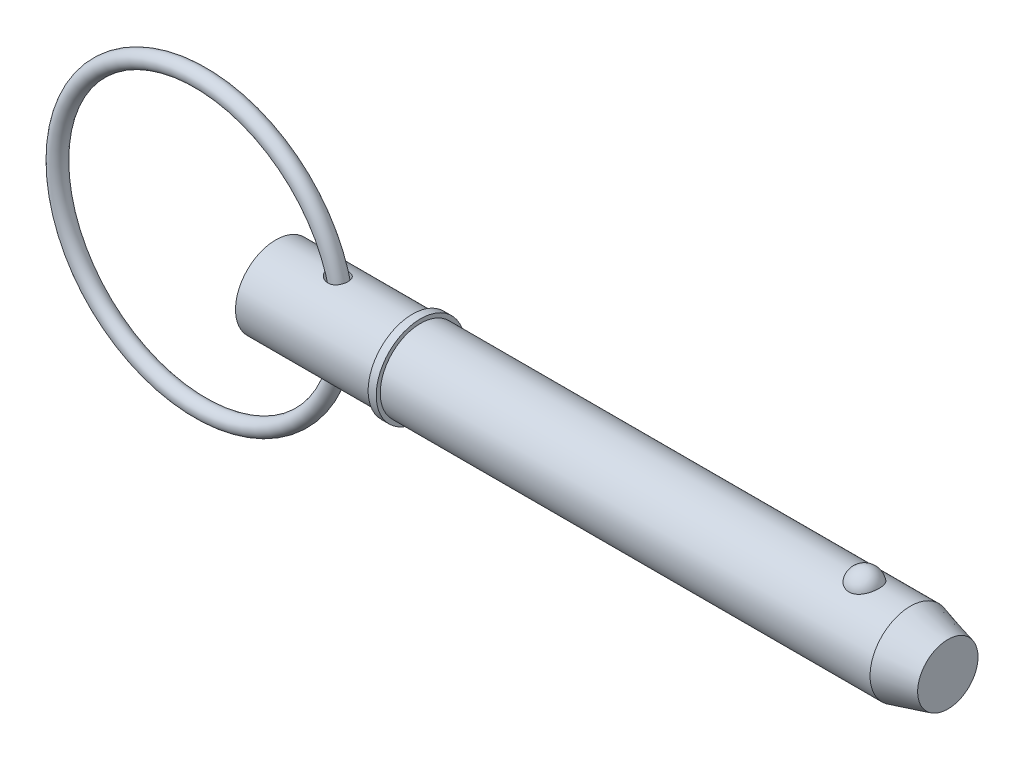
ISO-10303-21;
HEADER;
FILE_DESCRIPTION(('STEP AP214'),'2;1');
FILE_NAME('part.step','',(''),(''),'','','');
FILE_SCHEMA(('AUTOMOTIVE_DESIGN { 1 0 10303 214 1 1 1 1 }'));
ENDSEC;
DATA;
#1=APPLICATION_CONTEXT('core data for automotive mechanical design processes');
#2=APPLICATION_PROTOCOL_DEFINITION('international standard','automotive_design',2000,#1);
#3=PRODUCT_CONTEXT('',#1,'mechanical');
#4=PRODUCT('Part','Part','',(#3));
#5=PRODUCT_RELATED_PRODUCT_CATEGORY('part','',(#4));
#6=PRODUCT_DEFINITION_FORMATION('','',#4);
#7=PRODUCT_DEFINITION_CONTEXT('part definition',#1,'design');
#8=PRODUCT_DEFINITION('design','',#6,#7);
#9=PRODUCT_DEFINITION_SHAPE('','',#8);
#10=(LENGTH_UNIT() NAMED_UNIT(*) SI_UNIT(.MILLI.,.METRE.));
#11=(NAMED_UNIT(*) PLANE_ANGLE_UNIT() SI_UNIT($,.RADIAN.));
#12=(NAMED_UNIT(*) SI_UNIT($,.STERADIAN.) SOLID_ANGLE_UNIT());
#13=UNCERTAINTY_MEASURE_WITH_UNIT(LENGTH_MEASURE(1.E-05),#10,'distance_accuracy_value','');
#14=(GEOMETRIC_REPRESENTATION_CONTEXT(3) GLOBAL_UNCERTAINTY_ASSIGNED_CONTEXT((#13)) GLOBAL_UNIT_ASSIGNED_CONTEXT((#10,
#11,#12)) REPRESENTATION_CONTEXT('',''));
#15=CARTESIAN_POINT('',(0.,0.,0.));
#16=DIRECTION('',(0.,0.,1.));
#17=DIRECTION('',(1.,0.,0.));
#18=AXIS2_PLACEMENT_3D('',#15,#16,#17);
#19=CARTESIAN_POINT('',(-13.3805387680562,0.,0.));
#20=DIRECTION('',(0.,0.,1.));
#21=DIRECTION('',(1.,0.,0.));
#22=AXIS2_PLACEMENT_3D('',#19,#20,#21);
#23=TOROIDAL_SURFACE('',#22,25.4,1.429);
#24=CARTESIAN_POINT('',(13.4484612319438,0.,0.));
#25=VERTEX_POINT('',#24);
#26=VERTEX_LOOP('',#25);
#27=FACE_BOUND('',#26,.T.);
#28=ADVANCED_FACE('P0_F12',(#27),#23,.T.);
#29=CLOSED_SHELL('',(#28));
#30=MANIFOLD_SOLID_BREP('P0_B1',#29);
#31=CARTESIAN_POINT('',(0.,0.,0.));
#32=DIRECTION('',(1.,0.,0.));
#33=DIRECTION('',(0.,0.,-1.));
#34=AXIS2_PLACEMENT_3D('',#31,#32,#33);
#35=CYLINDRICAL_SURFACE('',#34,7.145);
#36=CARTESIAN_POINT('',(9.43029029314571,7.0820748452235,-0.946171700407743));
#37=CARTESIAN_POINT('',(9.49289741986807,7.07004660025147,-1.03619677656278));
#38=CARTESIAN_POINT('',(9.56370593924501,7.05703049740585,-1.12049617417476));
#39=CARTESIAN_POINT('',(9.71869321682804,7.03060933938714,-1.27585605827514));
#40=CARTESIAN_POINT('',(9.80290151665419,7.01720347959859,-1.34688652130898));
#41=CARTESIAN_POINT('',(9.98160385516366,6.99158714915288,-1.47408585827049));
#42=CARTESIAN_POINT('',(10.0760626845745,6.97937284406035,-1.53030346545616));
#43=CARTESIAN_POINT('',(10.2729508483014,6.95747410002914,-1.62697341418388));
#44=CARTESIAN_POINT('',(10.3753769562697,6.9477886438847,-1.66743209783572));
#45=CARTESIAN_POINT('',(10.5898946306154,6.93181594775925,-1.73266776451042));
#46=CARTESIAN_POINT('',(10.7022085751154,6.92567913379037,-1.75675727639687));
#47=CARTESIAN_POINT('',(10.9294935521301,6.91839634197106,-1.78523005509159));
#48=CARTESIAN_POINT('',(11.0444638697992,6.91724903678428,-1.78961856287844));
#49=CARTESIAN_POINT('',(11.2673249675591,6.92023954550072,-1.77801517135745));
#50=CARTESIAN_POINT('',(11.3752729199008,6.9241055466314,-1.7630715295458));
#51=CARTESIAN_POINT('',(11.5865707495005,6.93632220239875,-1.71437618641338));
#52=CARTESIAN_POINT('',(11.6899227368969,6.94467077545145,-1.68063321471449));
#53=CARTESIAN_POINT('',(11.8814537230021,6.96412118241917,-1.59802791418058));
#54=CARTESIAN_POINT('',(11.9701885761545,6.97498839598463,-1.55039425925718));
#55=CARTESIAN_POINT('',(12.1379548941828,6.99847346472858,-1.44066970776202));
#56=CARTESIAN_POINT('',(12.216987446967,7.01109112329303,-1.37858043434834));
#57=CARTESIAN_POINT('',(12.3614636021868,7.03632910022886,-1.24326778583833));
#58=CARTESIAN_POINT('',(12.4271729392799,7.04894297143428,-1.17032635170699));
#59=CARTESIAN_POINT('',(12.5455377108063,7.07306867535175,-1.01436746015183));
#60=CARTESIAN_POINT('',(12.5981928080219,7.08458047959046,-0.931349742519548));
#61=CARTESIAN_POINT('',(12.6896059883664,7.10535787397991,-0.75677050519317));
#62=CARTESIAN_POINT('',(12.7282356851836,7.11460247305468,-0.665139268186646));
#63=CARTESIAN_POINT('',(12.7900431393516,7.12971795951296,-0.476541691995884));
#64=CARTESIAN_POINT('',(12.8132203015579,7.13558871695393,-0.379575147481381));
#65=CARTESIAN_POINT('',(12.843715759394,7.14336270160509,-0.182249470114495));
#66=CARTESIAN_POINT('',(12.8509095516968,7.14523477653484,-0.0818698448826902));
#67=CARTESIAN_POINT('',(12.8489064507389,7.14471772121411,0.11871563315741));
#68=CARTESIAN_POINT('',(12.8397092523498,7.14232851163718,0.218921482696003));
#69=CARTESIAN_POINT('',(12.8051110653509,7.13353949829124,0.416446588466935));
#70=CARTESIAN_POINT('',(12.7796895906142,7.12713462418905,0.51376203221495));
#71=CARTESIAN_POINT('',(12.7132079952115,7.1110024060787,0.702607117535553));
#72=CARTESIAN_POINT('',(12.6721476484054,7.10127501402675,0.794136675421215));
#73=CARTESIAN_POINT('',(12.5754142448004,7.07957648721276,0.9686879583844));
#74=CARTESIAN_POINT('',(12.5197583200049,7.06760798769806,1.05171950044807));
#75=CARTESIAN_POINT('',(12.3951873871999,7.04275315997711,1.20699878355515));
#76=CARTESIAN_POINT('',(12.3262733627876,7.02986689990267,1.27924732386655));
#77=CARTESIAN_POINT('',(12.1775943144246,7.00473797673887,1.41035599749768));
#78=CARTESIAN_POINT('',(12.0979195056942,6.99249102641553,1.46931758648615));
#79=CARTESIAN_POINT('',(11.9295314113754,6.96991222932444,1.57295053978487));
#80=CARTESIAN_POINT('',(11.840819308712,6.9595801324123,1.61762377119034));
#81=CARTESIAN_POINT('',(11.6577653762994,6.94204625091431,1.69128599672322));
#82=CARTESIAN_POINT('',(11.5634812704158,6.93481718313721,1.72041226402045));
#83=CARTESIAN_POINT('',(11.3712731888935,6.92407027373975,1.76316901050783));
#84=CARTESIAN_POINT('',(11.2733489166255,6.92055273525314,1.7767982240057));
#85=CARTESIAN_POINT('',(11.0745092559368,6.91745053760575,1.78883853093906));
#86=CARTESIAN_POINT('',(10.9735737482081,6.91794816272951,1.7869312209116));
#87=CARTESIAN_POINT('',(10.7732766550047,6.92286647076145,1.76777696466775));
#88=CARTESIAN_POINT('',(10.6739155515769,6.92728833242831,1.75052540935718));
#89=CARTESIAN_POINT('',(10.4726907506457,6.93987626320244,1.69995986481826));
#90=CARTESIAN_POINT('',(10.3710860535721,6.94826759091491,1.66567223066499));
#91=CARTESIAN_POINT('',(10.1746512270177,6.96783543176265,1.5818155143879));
#92=CARTESIAN_POINT('',(10.0798244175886,6.97901329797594,1.53223900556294));
#93=CARTESIAN_POINT('',(9.89353725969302,7.00369413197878,1.41530336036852));
#94=CARTESIAN_POINT('',(9.80266896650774,7.01729943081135,1.34701798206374));
#95=CARTESIAN_POINT('',(9.63408859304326,7.0446567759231,1.19571433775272));
#96=CARTESIAN_POINT('',(9.55637809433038,7.05840883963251,1.11269430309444));
#97=CARTESIAN_POINT('',(9.41909992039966,7.083998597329,0.935821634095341));
#98=CARTESIAN_POINT('',(9.3591283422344,7.09587546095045,0.842290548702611));
#99=CARTESIAN_POINT('',(9.25811978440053,7.11649414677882,0.645207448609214));
#100=CARTESIAN_POINT('',(9.2170578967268,7.12524008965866,0.541668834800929));
#101=CARTESIAN_POINT('',(9.16044503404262,7.13745944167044,0.341322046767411));
#102=CARTESIAN_POINT('',(9.14237352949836,7.14144984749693,0.24525723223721));
#103=CARTESIAN_POINT('',(9.12416132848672,7.14547143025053,0.0513577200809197));
#104=CARTESIAN_POINT('',(9.12401221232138,7.14550446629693,-0.0464761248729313));
#105=CARTESIAN_POINT('',(9.14075660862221,7.14180686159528,-0.230866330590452));
#106=CARTESIAN_POINT('',(9.15598246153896,7.13844450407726,-0.317588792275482));
#107=CARTESIAN_POINT('',(9.20015637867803,7.1288735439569,-0.487231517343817));
#108=CARTESIAN_POINT('',(9.22909411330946,7.12266708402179,-0.570154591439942));
#109=CARTESIAN_POINT('',(9.2869632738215,7.11060500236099,-0.702183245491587));
#110=CARTESIAN_POINT('',(9.31233771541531,7.10538970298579,-0.752949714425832));
#111=CARTESIAN_POINT('',(9.36784352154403,7.09422889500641,-0.85170964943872));
#112=CARTESIAN_POINT('',(9.39797435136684,7.08828346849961,-0.899703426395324));
#113=CARTESIAN_POINT('',(9.43029029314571,7.0820748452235,-0.946171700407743));
#114=B_SPLINE_CURVE_WITH_KNOTS('',3,(#36,#37,#38,#39,#40,#41,#42,#43,#44,#45,#46,#47,#48,#49,
#50,#51,#52,#53,#54,#55,#56,#57,#58,#59,#60,#61,#62,#63,#64,#65,#66,#67,#68,#69,#70,#71,#72,#73,
#74,#75,#76,#77,#78,#79,#80,#81,#82,#83,#84,#85,#86,#87,#88,#89,#90,#91,#92,#93,#94,#95,#96,#97,
#98,#99,#100,#101,#102,#103,#104,#105,#106,#107,#108,#109,#110,#111,#112,#113),.UNSPECIFIED.,
.T.,.F.,(4,2,2,2,2,2,2,2,2,2,2,2,2,2,2,2,2,2,2,2,2,2,2,2,2,2,2,2,2,2,2,2,2,2,2,2,2,2,4),(0.,
0.330712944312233,0.662165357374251,0.992513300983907,1.32272815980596,1.66607248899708,
2.00932547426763,2.33472339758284,2.65997034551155,2.96236844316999,3.26473260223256,
3.56029376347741,3.85586255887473,4.15407251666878,4.45229395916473,4.75283038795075,
5.05337241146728,5.35429467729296,5.6552212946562,5.95579625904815,6.25634893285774,
6.55452242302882,6.85265693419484,7.14811357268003,7.44359434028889,7.74514565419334,
8.04678757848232,8.368090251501,8.68954924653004,9.03133562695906,9.37316306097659,
9.70647113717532,10.0393389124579,10.3311793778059,10.6228827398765,10.8860177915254,
11.1489549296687,11.3196783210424,11.4903825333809),.UNSPECIFIED.);
#115=CARTESIAN_POINT('',(9.43029029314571,7.0820748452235,-0.946171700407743));
#116=VERTEX_POINT('',#115);
#117=EDGE_CURVE('P1_E42',#116,#116,#114,.T.);
#118=ORIENTED_EDGE('',*,*,#117,.T.);
#119=EDGE_LOOP('',(#118));
#120=FACE_BOUND('',#119,.T.);
#121=CARTESIAN_POINT('',(0.,0.,0.));
#122=DIRECTION('',(1.,0.,0.));
#123=DIRECTION('',(0.,0.,-1.));
#124=AXIS2_PLACEMENT_3D('',#121,#122,#123);
#125=CIRCLE('',#124,7.145);
#126=CARTESIAN_POINT('',(0.,0.,-7.145));
#127=VERTEX_POINT('',#126);
#128=EDGE_CURVE('P1_E9',#127,#127,#125,.T.);
#129=ORIENTED_EDGE('',*,*,#128,.T.);
#130=EDGE_LOOP('',(#129));
#131=FACE_BOUND('',#130,.T.);
#132=CARTESIAN_POINT('',(24.271,0.,0.));
#133=DIRECTION('',(1.,0.,0.));
#134=DIRECTION('',(0.,0.,-1.));
#135=AXIS2_PLACEMENT_3D('',#132,#133,#134);
#136=CIRCLE('',#135,7.145);
#137=CARTESIAN_POINT('',(24.271,0.,-7.145));
#138=VERTEX_POINT('',#137);
#139=EDGE_CURVE('P1_E25',#138,#138,#136,.T.);
#140=ORIENTED_EDGE('',*,*,#139,.F.);
#141=EDGE_LOOP('',(#140));
#142=FACE_BOUND('',#141,.T.);
#143=CARTESIAN_POINT('',(9.43029029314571,-7.0820748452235,-0.946171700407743));
#144=CARTESIAN_POINT('',(9.37760063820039,-7.09219753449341,-0.870403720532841));
#145=CARTESIAN_POINT('',(9.33068640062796,-7.10162619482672,-0.790535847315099));
#146=CARTESIAN_POINT('',(9.25028000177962,-7.11818229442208,-0.624083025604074));
#147=CARTESIAN_POINT('',(9.21677847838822,-7.12531133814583,-0.537502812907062));
#148=CARTESIAN_POINT('',(9.16475883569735,-7.13651886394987,-0.359324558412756));
#149=CARTESIAN_POINT('',(9.14630423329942,-7.14058440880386,-0.267706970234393));
#150=CARTESIAN_POINT('',(9.12573334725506,-7.14512216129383,-0.0825612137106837));
#151=CARTESIAN_POINT('',(9.12361335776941,-7.1455951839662,0.0109665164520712));
#152=CARTESIAN_POINT('',(9.13548667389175,-7.14296952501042,0.191627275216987));
#153=CARTESIAN_POINT('',(9.14858103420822,-7.14007009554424,0.278824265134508));
#154=CARTESIAN_POINT('',(9.18869656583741,-7.1313430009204,0.449782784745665));
#155=CARTESIAN_POINT('',(9.21571947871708,-7.1255149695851,0.533543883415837));
#156=CARTESIAN_POINT('',(9.282939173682,-7.11140544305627,0.696984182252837));
#157=CARTESIAN_POINT('',(9.32334793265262,-7.10308469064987,0.7765721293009));
#158=CARTESIAN_POINT('',(9.41555290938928,-7.08481187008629,0.928623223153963));
#159=CARTESIAN_POINT('',(9.4673531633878,-7.07485922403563,1.00108383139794));
#160=CARTESIAN_POINT('',(9.58690514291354,-7.05302654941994,1.14530893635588));
#161=CARTESIAN_POINT('',(9.65578345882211,-7.04105486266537,1.21612477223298));
#162=CARTESIAN_POINT('',(9.80342908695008,-7.01727063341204,1.34660507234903));
#163=CARTESIAN_POINT('',(9.88220203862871,-7.00545818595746,1.40626312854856));
#164=CARTESIAN_POINT('',(10.0573217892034,-6.98177399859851,1.51973713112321));
#165=CARTESIAN_POINT('',(10.1546474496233,-6.9700532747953,1.57208037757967));
#166=CARTESIAN_POINT('',(10.3567277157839,-6.94950828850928,1.66055104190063));
#167=CARTESIAN_POINT('',(10.4614845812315,-6.94068491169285,1.69667350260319));
#168=CARTESIAN_POINT('',(10.6792116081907,-6.92685379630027,1.75230777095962));
#169=CARTESIAN_POINT('',(10.7923373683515,-6.92197732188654,1.77125049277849));
#170=CARTESIAN_POINT('',(11.0202699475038,-6.91736328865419,1.78919210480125));
#171=CARTESIAN_POINT('',(11.1350759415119,-6.91762328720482,1.78820047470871));
#172=CARTESIAN_POINT('',(11.355627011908,-6.92328130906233,1.76615765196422));
#173=CARTESIAN_POINT('',(11.4615007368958,-6.92836826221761,1.74632083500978));
#174=CARTESIAN_POINT('',(11.6678083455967,-6.94272508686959,1.68833625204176));
#175=CARTESIAN_POINT('',(11.7682443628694,-6.9519933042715,1.65019572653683));
#176=CARTESIAN_POINT('',(11.9539217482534,-6.97285816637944,1.55957439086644));
#177=CARTESIAN_POINT('',(12.0397280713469,-6.98426147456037,1.50820229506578));
#178=CARTESIAN_POINT('',(12.2011249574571,-7.00842344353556,1.39160266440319));
#179=CARTESIAN_POINT('',(12.276716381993,-7.0211819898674,1.32637629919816));
#180=CARTESIAN_POINT('',(12.4144868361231,-7.04639315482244,1.18508369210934));
#181=CARTESIAN_POINT('',(12.4768620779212,-7.05884739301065,1.10920872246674));
#182=CARTESIAN_POINT('',(12.5881779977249,-7.08230185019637,0.947973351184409));
#183=CARTESIAN_POINT('',(12.6371182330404,-7.09330202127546,0.862612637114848));
#184=CARTESIAN_POINT('',(12.7208404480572,-7.11277016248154,0.68387168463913));
#185=CARTESIAN_POINT('',(12.7554736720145,-7.12121129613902,0.590418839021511));
#186=CARTESIAN_POINT('',(12.8090653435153,-7.13450309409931,0.398877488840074));
#187=CARTESIAN_POINT('',(12.8280232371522,-7.13935363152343,0.300788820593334));
#188=CARTESIAN_POINT('',(12.8499077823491,-7.14496695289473,0.102058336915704));
#189=CARTESIAN_POINT('',(12.8527265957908,-7.14570223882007,0.00140385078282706));
#190=CARTESIAN_POINT('',(12.8419792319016,-7.14293198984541,-0.198968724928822));
#191=CARTESIAN_POINT('',(12.8284127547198,-7.13942637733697,-0.298686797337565));
#192=CARTESIAN_POINT('',(12.7851853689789,-7.12854635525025,-0.494442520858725));
#193=CARTESIAN_POINT('',(12.7555107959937,-7.12116866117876,-0.590476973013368));
#194=CARTESIAN_POINT('',(12.6807437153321,-7.10334272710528,-0.776042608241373));
#195=CARTESIAN_POINT('',(12.6356510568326,-7.09289445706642,-0.865573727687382));
#196=CARTESIAN_POINT('',(12.5312128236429,-7.07009703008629,-1.03541867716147));
#197=CARTESIAN_POINT('',(12.4718917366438,-7.0577511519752,-1.11574799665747));
#198=CARTESIAN_POINT('',(12.3404461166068,-7.03252701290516,-1.26504204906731));
#199=CARTESIAN_POINT('',(12.2683227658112,-7.01964880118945,-1.3340078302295));
#200=CARTESIAN_POINT('',(12.1139052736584,-6.99493588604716,-1.45803732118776));
#201=CARTESIAN_POINT('',(12.031708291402,-6.98309284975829,-1.51322032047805));
#202=CARTESIAN_POINT('',(11.858962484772,-6.96164945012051,-1.60900039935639));
#203=CARTESIAN_POINT('',(11.7684146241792,-6.95204882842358,-1.6495991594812));
#204=CARTESIAN_POINT('',(11.5822744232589,-6.93618392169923,-1.71508374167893));
#205=CARTESIAN_POINT('',(11.4867225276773,-6.92989640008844,-1.74007923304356));
#206=CARTESIAN_POINT('',(11.292703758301,-6.92114809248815,-1.77455680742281));
#207=CARTESIAN_POINT('',(11.1942365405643,-6.91868775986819,-1.7840370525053));
#208=CARTESIAN_POINT('',(10.9943797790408,-6.91771041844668,-1.78782317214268));
#209=CARTESIAN_POINT('',(10.8929824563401,-6.9193005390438,-1.78171679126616));
#210=CARTESIAN_POINT('',(10.6924353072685,-6.92632816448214,-1.75419409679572));
#211=CARTESIAN_POINT('',(10.5932861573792,-6.93176681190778,-1.73277323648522));
#212=CARTESIAN_POINT('',(10.3927770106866,-6.94630717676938,-1.67356884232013));
#213=CARTESIAN_POINT('',(10.2917367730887,-6.95563581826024,-1.63475796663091));
#214=CARTESIAN_POINT('',(10.0971768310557,-6.97681957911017,-1.54184188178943));
#215=CARTESIAN_POINT('',(10.0036623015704,-6.9886764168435,-1.48772626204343));
#216=CARTESIAN_POINT('',(9.82098935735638,-7.01440230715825,-1.36146688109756));
#217=CARTESIAN_POINT('',(9.73247440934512,-7.0283510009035,-1.28840361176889));
#218=CARTESIAN_POINT('',(9.56978695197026,-7.05591334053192,-1.12770855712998));
#219=CARTESIAN_POINT('',(9.49560170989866,-7.06952727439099,-1.0400898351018));
#220=CARTESIAN_POINT('',(9.43029029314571,-7.0820748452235,-0.946171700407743));
#221=B_SPLINE_CURVE_WITH_KNOTS('',3,(#143,#144,#145,#146,#147,#148,#149,#150,#151,#152,#153,
#154,#155,#156,#157,#158,#159,#160,#161,#162,#163,#164,#165,#166,#167,#168,#169,#170,#171,#172,
#173,#174,#175,#176,#177,#178,#179,#180,#181,#182,#183,#184,#185,#186,#187,#188,#189,#190,#191,
#192,#193,#194,#195,#196,#197,#198,#199,#200,#201,#202,#203,#204,#205,#206,#207,#208,#209,#210,
#211,#212,#213,#214,#215,#216,#217,#218,#219,#220),.UNSPECIFIED.,.T.,.F.,(4,2,2,2,2,2,2,2,2,2,2,
2,2,2,2,2,2,2,2,2,2,2,2,2,2,2,2,2,2,2,2,2,2,2,2,2,2,2,4),(0.,0.278197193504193,
0.556199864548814,0.835370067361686,1.11447693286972,1.37789669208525,1.64134939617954,
1.9091912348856,2.17712812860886,2.4744625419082,2.77196719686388,3.10386520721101,
3.43586457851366,3.77849767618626,4.1209678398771,4.44276705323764,4.76443907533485,
5.06494526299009,5.36542609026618,5.6610728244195,5.95672929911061,6.25538683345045,
6.5540549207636,6.85471634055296,7.15538326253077,7.45630563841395,7.75723095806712,
8.05764204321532,8.35802540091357,8.65571107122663,8.95336242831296,9.24889743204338,
9.54446744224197,9.84793560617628,10.1514939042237,10.4760045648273,10.8007364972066,
11.1458836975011,11.4907227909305),.UNSPECIFIED.);
#222=CARTESIAN_POINT('',(9.43029029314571,-7.0820748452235,-0.946171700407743));
#223=VERTEX_POINT('',#222);
#224=EDGE_CURVE('P1_E17',#223,#223,#221,.T.);
#225=ORIENTED_EDGE('',*,*,#224,.T.);
#226=EDGE_LOOP('',(#225));
#227=FACE_BOUND('',#226,.T.);
#228=ADVANCED_FACE('P1_F13',(#120,#131,#142,#227),#35,.T.);
#229=CARTESIAN_POINT('',(0.,0.,0.));
#230=DIRECTION('',(1.,0.,0.));
#231=DIRECTION('',(0.,0.,-1.));
#232=AXIS2_PLACEMENT_3D('',#229,#230,#231);
#233=CYLINDRICAL_SURFACE('',#232,7.145);
#234=CARTESIAN_POINT('',(112.68362424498,0.,0.));
#235=DIRECTION('',(1.,0.,0.));
#236=DIRECTION('',(0.,0.,-1.));
#237=AXIS2_PLACEMENT_3D('',#234,#235,#236);
#238=CIRCLE('',#237,7.145);
#239=CARTESIAN_POINT('',(112.68362424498,0.,-7.145));
#240=VERTEX_POINT('',#239);
#241=EDGE_CURVE('P1_E99',#240,#240,#238,.T.);
#242=ORIENTED_EDGE('',*,*,#241,.F.);
#243=EDGE_LOOP('',(#242));
#244=FACE_BOUND('',#243,.T.);
#245=CARTESIAN_POINT('',(25.7,0.,0.));
#246=DIRECTION('',(1.,0.,0.));
#247=DIRECTION('',(0.,0.,-1.));
#248=AXIS2_PLACEMENT_3D('',#245,#246,#247);
#249=CIRCLE('',#248,7.145);
#250=CARTESIAN_POINT('',(25.7,0.,-7.145));
#251=VERTEX_POINT('',#250);
#252=EDGE_CURVE('P1_E96',#251,#251,#249,.T.);
#253=ORIENTED_EDGE('',*,*,#252,.T.);
#254=EDGE_LOOP('',(#253));
#255=FACE_BOUND('',#254,.T.);
#256=CARTESIAN_POINT('',(104.539503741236,6.6032862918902,2.72903557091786));
#257=CARTESIAN_POINT('',(104.398315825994,6.60329644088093,2.72902496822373));
#258=CARTESIAN_POINT('',(104.256883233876,6.60799490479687,2.71772840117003));
#259=CARTESIAN_POINT('',(103.977955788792,6.62628236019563,2.67281935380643));
#260=CARTESIAN_POINT('',(103.840472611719,6.63989534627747,2.63914664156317));
#261=CARTESIAN_POINT('',(103.573889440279,6.67440775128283,2.55059642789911));
#262=CARTESIAN_POINT('',(103.444768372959,6.69528793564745,2.49577486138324));
#263=CARTESIAN_POINT('',(103.197869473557,6.74205585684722,2.36651799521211));
#264=CARTESIAN_POINT('',(103.080086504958,6.76794130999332,2.29209163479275));
#265=CARTESIAN_POINT('',(102.85516710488,6.82286177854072,2.12312937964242));
#266=CARTESIAN_POINT('',(102.748440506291,6.85196655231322,2.02807107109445));
#267=CARTESIAN_POINT('',(102.551918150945,6.90970232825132,1.82167822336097));
#268=CARTESIAN_POINT('',(102.462127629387,6.93833318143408,1.71033867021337));
#269=CARTESIAN_POINT('',(102.297667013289,6.99351679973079,1.46891951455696));
#270=CARTESIAN_POINT('',(102.223844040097,7.01992110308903,1.33822781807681));
#271=CARTESIAN_POINT('',(102.098088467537,7.06643385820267,1.06566567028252));
#272=CARTESIAN_POINT('',(102.04615735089,7.08654188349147,0.923794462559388));
#273=CARTESIAN_POINT('',(101.964732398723,7.11862399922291,0.63099329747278));
#274=CARTESIAN_POINT('',(101.935516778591,7.13049704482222,0.479974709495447));
#275=CARTESIAN_POINT('',(101.901174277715,7.14449484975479,0.174782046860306));
#276=CARTESIAN_POINT('',(101.896046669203,7.14661990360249,0.020608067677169));
#277=CARTESIAN_POINT('',(101.909938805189,7.14092465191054,-0.285506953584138));
#278=CARTESIAN_POINT('',(101.928810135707,7.1331654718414,-0.437455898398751));
#279=CARTESIAN_POINT('',(101.990062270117,7.10859076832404,-0.735778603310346));
#280=CARTESIAN_POINT('',(102.032443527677,7.0917750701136,-0.88215225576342));
#281=CARTESIAN_POINT('',(102.139934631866,7.05076716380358,-1.165431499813));
#282=CARTESIAN_POINT('',(102.205075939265,7.02656475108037,-1.30232366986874));
#283=CARTESIAN_POINT('',(102.356759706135,6.97329145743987,-1.56265907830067));
#284=CARTESIAN_POINT('',(102.443303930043,6.94422017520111,-1.68610120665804));
#285=CARTESIAN_POINT('',(102.636465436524,6.88415108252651,-1.91671004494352));
#286=CARTESIAN_POINT('',(102.743180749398,6.85314438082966,-2.02379244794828));
#287=CARTESIAN_POINT('',(102.973974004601,6.79282069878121,-2.21787433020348));
#288=CARTESIAN_POINT('',(103.098050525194,6.76350358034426,-2.30487545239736));
#289=CARTESIAN_POINT('',(103.357678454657,6.71060580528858,-2.45458647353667));
#290=CARTESIAN_POINT('',(103.492938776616,6.68691885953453,-2.51776240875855));
#291=CARTESIAN_POINT('',(103.773277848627,6.64741247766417,-2.62030218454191));
#292=CARTESIAN_POINT('',(103.918352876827,6.63159007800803,-2.65967499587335));
#293=CARTESIAN_POINT('',(104.206347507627,6.61038594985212,-2.71193301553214));
#294=CARTESIAN_POINT('',(104.34900807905,6.60451880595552,-2.72605165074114));
#295=CARTESIAN_POINT('',(104.634800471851,6.60240611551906,-2.73116688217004));
#296=CARTESIAN_POINT('',(104.777932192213,6.60615862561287,-2.72216814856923));
#297=CARTESIAN_POINT('',(105.055848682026,6.62256094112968,-2.68200435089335));
#298=CARTESIAN_POINT('',(105.190754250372,6.63492533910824,-2.65154998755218));
#299=CARTESIAN_POINT('',(105.45332009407,6.66687445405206,-2.57015684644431));
#300=CARTESIAN_POINT('',(105.58097978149,6.68645975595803,-2.51921640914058));
#301=CARTESIAN_POINT('',(105.828577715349,6.731272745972,-2.39693610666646));
#302=CARTESIAN_POINT('',(105.948287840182,6.75661381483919,-2.32517694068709));
#303=CARTESIAN_POINT('',(106.174159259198,6.8100600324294,-2.16363812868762));
#304=CARTESIAN_POINT('',(106.280317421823,6.83816581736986,-2.07385432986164));
#305=CARTESIAN_POINT('',(106.481862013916,6.89580469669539,-1.87357235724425));
#306=CARTESIAN_POINT('',(106.576440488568,6.92533863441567,-1.76226074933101));
#307=CARTESIAN_POINT('',(106.746332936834,6.98139526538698,-1.52511696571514));
#308=CARTESIAN_POINT('',(106.821643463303,7.0079174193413,-1.39928219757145));
#309=CARTESIAN_POINT('',(106.953595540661,7.0560762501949,-1.13215977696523));
#310=CARTESIAN_POINT('',(107.009568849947,7.07753119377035,-0.99050847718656));
#311=CARTESIAN_POINT('',(107.098296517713,7.11222355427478,-0.699154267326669));
#312=CARTESIAN_POINT('',(107.131050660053,7.12546089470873,-0.549451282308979));
#313=CARTESIAN_POINT('',(107.172689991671,7.1423758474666,-0.2461206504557));
#314=CARTESIAN_POINT('',(107.181558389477,7.14604673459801,-0.0924903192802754));
#315=CARTESIAN_POINT('',(107.175194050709,7.14343510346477,0.214181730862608));
#316=CARTESIAN_POINT('',(107.159961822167,7.13715279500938,0.367223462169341));
#317=CARTESIAN_POINT('',(107.105845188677,7.1153294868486,0.667595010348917));
#318=CARTESIAN_POINT('',(107.067077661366,7.09983424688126,0.814949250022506));
#319=CARTESIAN_POINT('',(106.966770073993,7.06119140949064,1.10063221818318));
#320=CARTESIAN_POINT('',(106.905228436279,7.03804328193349,1.238960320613));
#321=CARTESIAN_POINT('',(106.760207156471,6.98632429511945,1.50352300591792));
#322=CARTESIAN_POINT('',(106.676606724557,6.95772382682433,1.62968561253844));
#323=CARTESIAN_POINT('',(106.48938046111,6.89823072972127,1.86554304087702));
#324=CARTESIAN_POINT('',(106.385755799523,6.86733823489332,1.97523882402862));
#325=CARTESIAN_POINT('',(106.161076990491,6.80676456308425,2.174822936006));
#326=CARTESIAN_POINT('',(106.040067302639,6.7770805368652,2.26476035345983));
#327=CARTESIAN_POINT('',(105.783340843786,6.72230501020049,2.42252989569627));
#328=CARTESIAN_POINT('',(105.64761851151,6.69721525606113,2.49035362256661));
#329=CARTESIAN_POINT('',(105.370402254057,6.65552591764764,2.59967646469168));
#330=CARTESIAN_POINT('',(105.229281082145,6.63865794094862,2.64202017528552));
#331=CARTESIAN_POINT('',(104.941444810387,6.6142503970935,2.70255841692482));
#332=CARTESIAN_POINT('',(104.794748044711,6.60668259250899,2.72082606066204));
#333=CARTESIAN_POINT('',(104.611679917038,6.60358754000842,2.7283033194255));
#334=CARTESIAN_POINT('',(104.575599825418,6.60328369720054,2.72903828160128));
#335=CARTESIAN_POINT('',(104.539503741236,6.6032862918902,2.72903557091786));
#336=B_SPLINE_CURVE_WITH_KNOTS('',3,(#256,#257,#258,#259,#260,#261,#262,#263,#264,#265,#266,
#267,#268,#269,#270,#271,#272,#273,#274,#275,#276,#277,#278,#279,#280,#281,#282,#283,#284,#285,
#286,#287,#288,#289,#290,#291,#292,#293,#294,#295,#296,#297,#298,#299,#300,#301,#302,#303,#304,
#305,#306,#307,#308,#309,#310,#311,#312,#313,#314,#315,#316,#317,#318,#319,#320,#321,#322,#323,
#324,#325,#326,#327,#328,#329,#330,#331,#332,#333,#334,#335),.UNSPECIFIED.,.T.,.F.,(4,2,2,2,2,2,
2,2,2,2,2,2,2,2,2,2,2,2,2,2,2,2,2,2,2,2,2,2,2,2,2,2,2,2,2,2,2,2,2,4),(0.,0.423468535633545,
0.848081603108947,1.27157926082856,1.69488414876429,2.13051395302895,2.56627819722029,
3.02136706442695,3.47648674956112,3.93709649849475,4.3976923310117,4.85545355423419,
5.31322361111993,5.77162895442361,6.23007210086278,6.69080337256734,7.15149693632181,
7.60264329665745,8.05361952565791,8.48189729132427,8.91008854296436,9.32472524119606,
9.73939553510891,10.1630783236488,10.5868588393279,11.031907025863,11.4770347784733,
11.9362874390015,12.3955443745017,12.8551240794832,13.3146940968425,13.7720003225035,
14.2293382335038,14.6892343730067,15.1491036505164,15.6078171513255,16.0667046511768,
16.5093965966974,16.9507410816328,17.0590049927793),.UNSPECIFIED.);
#337=CARTESIAN_POINT('',(104.539503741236,6.6032862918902,2.72903557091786));
#338=VERTEX_POINT('',#337);
#339=EDGE_CURVE('P1_E34',#338,#338,#336,.T.);
#340=ORIENTED_EDGE('',*,*,#339,.T.);
#341=EDGE_LOOP('',(#340));
#342=FACE_BOUND('',#341,.T.);
#343=ADVANCED_FACE('P1_F46',(#244,#255,#342),#233,.T.);
#344=CARTESIAN_POINT('',(0.,0.,0.));
#345=DIRECTION('',(-1.,0.,0.));
#346=DIRECTION('',(0.,0.,1.));
#347=AXIS2_PLACEMENT_3D('',#344,#345,#346);
#348=PLANE('',#347);
#349=ORIENTED_EDGE('',*,*,#128,.F.);
#350=EDGE_LOOP('',(#349));
#351=FACE_BOUND('',#350,.T.);
#352=ADVANCED_FACE('P1_F15',(#351),#348,.T.);
#353=CARTESIAN_POINT('',(24.271,7.145,0.));
#354=DIRECTION('',(-1.,0.,0.));
#355=DIRECTION('',(0.,0.,1.));
#356=AXIS2_PLACEMENT_3D('',#353,#354,#355);
#357=PLANE('',#356);
#358=ORIENTED_EDGE('',*,*,#139,.T.);
#359=EDGE_LOOP('',(#358));
#360=FACE_BOUND('',#359,.T.);
#361=CARTESIAN_POINT('',(24.271,0.,0.));
#362=DIRECTION('',(1.,0.,0.));
#363=DIRECTION('',(0.,0.,-1.));
#364=AXIS2_PLACEMENT_3D('',#361,#362,#363);
#365=CIRCLE('',#364,7.8595);
#366=CARTESIAN_POINT('',(24.271,0.,-7.8595));
#367=VERTEX_POINT('',#366);
#368=EDGE_CURVE('P1_E30',#367,#367,#365,.T.);
#369=ORIENTED_EDGE('',*,*,#368,.F.);
#370=EDGE_LOOP('',(#369));
#371=FACE_BOUND('',#370,.T.);
#372=ADVANCED_FACE('P1_F81',(#360,#371),#357,.T.);
#373=CARTESIAN_POINT('',(0.,0.,0.));
#374=DIRECTION('',(1.,0.,0.));
#375=DIRECTION('',(0.,0.,-1.));
#376=AXIS2_PLACEMENT_3D('',#373,#374,#375);
#377=CYLINDRICAL_SURFACE('',#376,7.8595);
#378=ORIENTED_EDGE('',*,*,#368,.T.);
#379=EDGE_LOOP('',(#378));
#380=FACE_BOUND('',#379,.T.);
#381=CARTESIAN_POINT('',(25.7,0.,0.));
#382=DIRECTION('',(1.,0.,0.));
#383=DIRECTION('',(0.,0.,-1.));
#384=AXIS2_PLACEMENT_3D('',#381,#382,#383);
#385=CIRCLE('',#384,7.8595);
#386=CARTESIAN_POINT('',(25.7,0.,-7.8595));
#387=VERTEX_POINT('',#386);
#388=EDGE_CURVE('P1_E95',#387,#387,#385,.T.);
#389=ORIENTED_EDGE('',*,*,#388,.F.);
#390=EDGE_LOOP('',(#389));
#391=FACE_BOUND('',#390,.T.);
#392=ADVANCED_FACE('P1_F68',(#380,#391),#377,.T.);
#393=CARTESIAN_POINT('',(25.7,7.8595,0.));
#394=DIRECTION('',(1.,0.,0.));
#395=DIRECTION('',(0.,0.,-1.));
#396=AXIS2_PLACEMENT_3D('',#393,#394,#395);
#397=PLANE('',#396);
#398=ORIENTED_EDGE('',*,*,#388,.T.);
#399=EDGE_LOOP('',(#398));
#400=FACE_BOUND('',#399,.T.);
#401=ORIENTED_EDGE('',*,*,#252,.F.);
#402=EDGE_LOOP('',(#401));
#403=FACE_BOUND('',#402,.T.);
#404=ADVANCED_FACE('P1_F62',(#400,#403),#397,.T.);
#405=CARTESIAN_POINT('',(119.35,0.,0.));
#406=DIRECTION('',(-1.,0.,0.));
#407=DIRECTION('',(0.,0.,1.));
#408=AXIS2_PLACEMENT_3D('',#405,#406,#407);
#409=CONICAL_SURFACE('',#408,5.35875000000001,0.26179938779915);
#410=ORIENTED_EDGE('',*,*,#241,.T.);
#411=EDGE_LOOP('',(#410));
#412=FACE_BOUND('',#411,.T.);
#413=CARTESIAN_POINT('',(119.35,0.,0.));
#414=DIRECTION('',(1.,0.,0.));
#415=DIRECTION('',(0.,0.,-1.));
#416=AXIS2_PLACEMENT_3D('',#413,#414,#415);
#417=CIRCLE('',#416,5.35875000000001);
#418=CARTESIAN_POINT('',(119.35,0.,-5.35875000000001));
#419=VERTEX_POINT('',#418);
#420=EDGE_CURVE('P1_E41',#419,#419,#417,.T.);
#421=ORIENTED_EDGE('',*,*,#420,.F.);
#422=EDGE_LOOP('',(#421));
#423=FACE_BOUND('',#422,.T.);
#424=ADVANCED_FACE('P1_F59',(#412,#423),#409,.T.);
#425=CARTESIAN_POINT('',(119.35,5.35875000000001,0.));
#426=DIRECTION('',(1.,0.,0.));
#427=DIRECTION('',(0.,0.,-1.));
#428=AXIS2_PLACEMENT_3D('',#425,#426,#427);
#429=PLANE('',#428);
#430=ORIENTED_EDGE('',*,*,#420,.T.);
#431=EDGE_LOOP('',(#430));
#432=FACE_BOUND('',#431,.T.);
#433=ADVANCED_FACE('P1_F55',(#432),#429,.T.);
#434=CARTESIAN_POINT('',(104.539503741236,6.4305,0.));
#435=DIRECTION('',(-1.,0.,0.));
#436=DIRECTION('',(0.,1.,0.));
#437=AXIS2_PLACEMENT_3D('',#434,#435,#436);
#438=SPHERICAL_SURFACE('',#437,2.73450000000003);
#439=ORIENTED_EDGE('',*,*,#339,.F.);
#440=EDGE_LOOP('',(#439));
#441=FACE_BOUND('',#440,.T.);
#442=ADVANCED_FACE('P1_F50',(#441),#438,.T.);
#443=CARTESIAN_POINT('',(-13.3805387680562,0.,0.));
#444=DIRECTION('',(0.,0.,1.));
#445=DIRECTION('',(1.,0.,0.));
#446=AXIS2_PLACEMENT_3D('',#443,#444,#445);
#447=TOROIDAL_SURFACE('',#446,25.4,1.78625);
#448=ORIENTED_EDGE('',*,*,#224,.F.);
#449=EDGE_LOOP('',(#448));
#450=FACE_BOUND('',#449,.T.);
#451=ORIENTED_EDGE('',*,*,#117,.F.);
#452=EDGE_LOOP('',(#451));
#453=FACE_BOUND('',#452,.T.);
#454=ADVANCED_FACE('P1_F54',(#450,#453),#447,.F.);
#455=CLOSED_SHELL('',(#228,#343,#352,#372,#392,#404,#424,#433,#442,#454));
#456=MANIFOLD_SOLID_BREP('P1_B1',#455);
#457=ADVANCED_BREP_SHAPE_REPRESENTATION('',(#18,#30,#456),#14);
#458=SHAPE_DEFINITION_REPRESENTATION(#9,#457);
ENDSEC;
END-ISO-10303-21;
